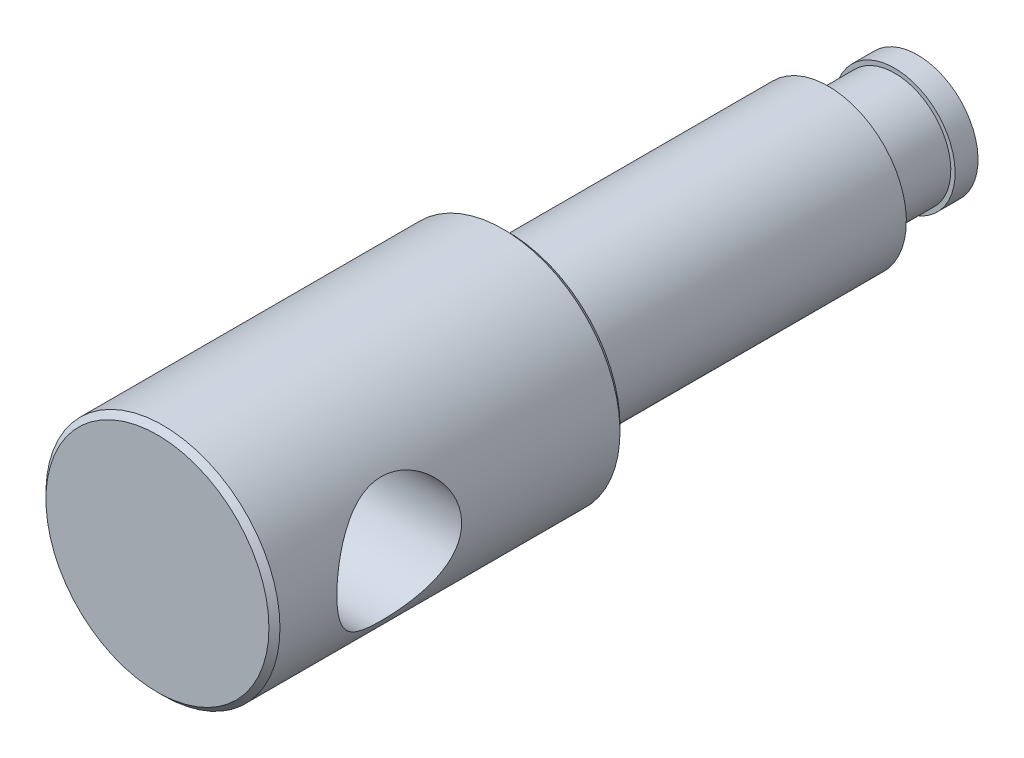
ISO-10303-21;
HEADER;
FILE_DESCRIPTION(('STEP AP214'),'2;1');
FILE_NAME('part.step','',(''),(''),'','','');
FILE_SCHEMA(('AUTOMOTIVE_DESIGN { 1 0 10303 214 1 1 1 1 }'));
ENDSEC;
DATA;
#1=APPLICATION_CONTEXT('core data for automotive mechanical design processes');
#2=APPLICATION_PROTOCOL_DEFINITION('international standard','automotive_design',2000,#1);
#3=PRODUCT_CONTEXT('',#1,'mechanical');
#4=PRODUCT('Part','Part','',(#3));
#5=PRODUCT_RELATED_PRODUCT_CATEGORY('part','',(#4));
#6=PRODUCT_DEFINITION_FORMATION('','',#4);
#7=PRODUCT_DEFINITION_CONTEXT('part definition',#1,'design');
#8=PRODUCT_DEFINITION('design','',#6,#7);
#9=PRODUCT_DEFINITION_SHAPE('','',#8);
#10=(LENGTH_UNIT() NAMED_UNIT(*) SI_UNIT(.MILLI.,.METRE.));
#11=(NAMED_UNIT(*) PLANE_ANGLE_UNIT() SI_UNIT($,.RADIAN.));
#12=(NAMED_UNIT(*) SI_UNIT($,.STERADIAN.) SOLID_ANGLE_UNIT());
#13=UNCERTAINTY_MEASURE_WITH_UNIT(LENGTH_MEASURE(1.E-05),#10,'distance_accuracy_value','');
#14=(GEOMETRIC_REPRESENTATION_CONTEXT(3) GLOBAL_UNCERTAINTY_ASSIGNED_CONTEXT((#13)) GLOBAL_UNIT_ASSIGNED_CONTEXT((#10,
#11,#12)) REPRESENTATION_CONTEXT('',''));
#15=CARTESIAN_POINT('',(0.,0.,0.));
#16=DIRECTION('',(0.,0.,1.));
#17=DIRECTION('',(1.,0.,0.));
#18=AXIS2_PLACEMENT_3D('',#15,#16,#17);
#19=CARTESIAN_POINT('',(0.,0.,13.));
#20=DIRECTION('',(-1.,0.,0.));
#21=DIRECTION('',(0.,1.,0.));
#22=AXIS2_PLACEMENT_3D('',#19,#20,#21);
#23=SPHERICAL_SURFACE('',#22,13.);
#24=CARTESIAN_POINT('',(0.,0.,2.56268712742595));
#25=DIRECTION('',(0.,0.,1.));
#26=DIRECTION('',(0.,-1.,0.));
#27=AXIS2_PLACEMENT_3D('',#24,#25,#26);
#28=CIRCLE('',#27,7.75);
#29=CARTESIAN_POINT('',(0.,-7.75,2.56268712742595));
#30=VERTEX_POINT('',#29);
#31=EDGE_CURVE('E112',#30,#30,#28,.T.);
#32=ORIENTED_EDGE('',*,*,#31,.F.);
#33=EDGE_LOOP('',(#32));
#34=FACE_BOUND('',#33,.T.);
#35=ADVANCED_FACE('F12',(#34),#23,.T.);
#36=CARTESIAN_POINT('',(0.,0.,0.));
#37=DIRECTION('',(0.,0.,1.));
#38=DIRECTION('',(0.,-1.,0.));
#39=AXIS2_PLACEMENT_3D('',#36,#37,#38);
#40=CYLINDRICAL_SURFACE('',#39,7.75);
#41=CARTESIAN_POINT('',(0.,0.,5.5));
#42=DIRECTION('',(0.,0.,1.));
#43=DIRECTION('',(0.,-1.,0.));
#44=AXIS2_PLACEMENT_3D('',#41,#42,#43);
#45=CIRCLE('',#44,7.75);
#46=CARTESIAN_POINT('',(0.,-7.75,5.5));
#47=VERTEX_POINT('',#46);
#48=EDGE_CURVE('E113',#47,#47,#45,.F.);
#49=ORIENTED_EDGE('',*,*,#48,.T.);
#50=EDGE_LOOP('',(#49));
#51=FACE_BOUND('',#50,.T.);
#52=ORIENTED_EDGE('',*,*,#31,.T.);
#53=EDGE_LOOP('',(#52));
#54=FACE_BOUND('',#53,.T.);
#55=ADVANCED_FACE('F75',(#51,#54),#40,.T.);
#56=CARTESIAN_POINT('',(7.2,0.,5.5));
#57=DIRECTION('',(0.,0.,-1.));
#58=DIRECTION('',(0.,1.,0.));
#59=AXIS2_PLACEMENT_3D('',#56,#57,#58);
#60=PLANE('',#59);
#61=CARTESIAN_POINT('',(0.,0.,5.5));
#62=DIRECTION('',(0.,0.,1.));
#63=DIRECTION('',(0.,-1.,0.));
#64=AXIS2_PLACEMENT_3D('',#61,#62,#63);
#65=CIRCLE('',#64,7.2);
#66=CARTESIAN_POINT('',(0.,-7.2,5.5));
#67=VERTEX_POINT('',#66);
#68=EDGE_CURVE('E94',#67,#67,#65,.T.);
#69=ORIENTED_EDGE('',*,*,#68,.F.);
#70=EDGE_LOOP('',(#69));
#71=FACE_BOUND('',#70,.T.);
#72=ORIENTED_EDGE('',*,*,#48,.F.);
#73=EDGE_LOOP('',(#72));
#74=FACE_BOUND('',#73,.T.);
#75=ADVANCED_FACE('F71',(#71,#74),#60,.F.);
#76=CARTESIAN_POINT('',(0.,0.,0.));
#77=DIRECTION('',(0.,0.,1.));
#78=DIRECTION('',(0.,-1.,0.));
#79=AXIS2_PLACEMENT_3D('',#76,#77,#78);
#80=CYLINDRICAL_SURFACE('',#79,7.2);
#81=CARTESIAN_POINT('',(0.,0.,12.383419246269));
#82=DIRECTION('',(0.,0.,1.));
#83=DIRECTION('',(0.,-1.,0.));
#84=AXIS2_PLACEMENT_3D('',#81,#82,#83);
#85=CIRCLE('',#84,7.2);
#86=CARTESIAN_POINT('',(0.,-7.2,12.383419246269));
#87=VERTEX_POINT('',#86);
#88=EDGE_CURVE('E90',#87,#87,#85,.T.);
#89=ORIENTED_EDGE('',*,*,#88,.F.);
#90=EDGE_LOOP('',(#89));
#91=FACE_BOUND('',#90,.T.);
#92=ORIENTED_EDGE('',*,*,#68,.T.);
#93=EDGE_LOOP('',(#92));
#94=FACE_BOUND('',#93,.T.);
#95=ADVANCED_FACE('F67',(#91,#94),#80,.T.);
#96=CARTESIAN_POINT('',(0.,0.,14.));
#97=DIRECTION('',(0.,0.,1.));
#98=DIRECTION('',(-1.,0.,0.));
#99=AXIS2_PLACEMENT_3D('',#96,#97,#98);
#100=CONICAL_SURFACE('',#99,10.,1.0471975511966);
#101=CARTESIAN_POINT('',(0.,0.,14.));
#102=DIRECTION('',(0.,0.,1.));
#103=DIRECTION('',(0.,-1.,0.));
#104=AXIS2_PLACEMENT_3D('',#101,#102,#103);
#105=CIRCLE('',#104,10.);
#106=CARTESIAN_POINT('',(0.,-10.,14.));
#107=VERTEX_POINT('',#106);
#108=EDGE_CURVE('E97',#107,#107,#105,.T.);
#109=ORIENTED_EDGE('',*,*,#108,.F.);
#110=EDGE_LOOP('',(#109));
#111=FACE_BOUND('',#110,.T.);
#112=ORIENTED_EDGE('',*,*,#88,.T.);
#113=EDGE_LOOP('',(#112));
#114=FACE_BOUND('',#113,.T.);
#115=ADVANCED_FACE('F63',(#111,#114),#100,.T.);
#116=CARTESIAN_POINT('',(0.,0.,0.));
#117=DIRECTION('',(0.,0.,1.));
#118=DIRECTION('',(0.,-1.,0.));
#119=AXIS2_PLACEMENT_3D('',#116,#117,#118);
#120=CYLINDRICAL_SURFACE('',#119,10.);
#121=CARTESIAN_POINT('',(0.,0.,55.));
#122=DIRECTION('',(0.,0.,1.));
#123=DIRECTION('',(0.,-1.,0.));
#124=AXIS2_PLACEMENT_3D('',#121,#122,#123);
#125=CIRCLE('',#124,10.);
#126=CARTESIAN_POINT('',(0.,-10.,55.));
#127=VERTEX_POINT('',#126);
#128=EDGE_CURVE('E93',#127,#127,#125,.F.);
#129=ORIENTED_EDGE('',*,*,#128,.T.);
#130=EDGE_LOOP('',(#129));
#131=FACE_BOUND('',#130,.T.);
#132=ORIENTED_EDGE('',*,*,#108,.T.);
#133=EDGE_LOOP('',(#132));
#134=FACE_BOUND('',#133,.T.);
#135=ADVANCED_FACE('F59',(#131,#134),#120,.T.);
#136=CARTESIAN_POINT('',(14.2928932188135,0.,55.));
#137=DIRECTION('',(0.,0.,1.));
#138=DIRECTION('',(0.,-1.,0.));
#139=AXIS2_PLACEMENT_3D('',#136,#137,#138);
#140=PLANE('',#139);
#141=CARTESIAN_POINT('',(0.,0.,55.));
#142=DIRECTION('',(0.,0.,1.));
#143=DIRECTION('',(0.,-1.,0.));
#144=AXIS2_PLACEMENT_3D('',#141,#142,#143);
#145=CIRCLE('',#144,14.2928932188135);
#146=CARTESIAN_POINT('',(0.,-14.2928932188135,55.));
#147=VERTEX_POINT('',#146);
#148=EDGE_CURVE('E100',#147,#147,#145,.T.);
#149=ORIENTED_EDGE('',*,*,#148,.F.);
#150=EDGE_LOOP('',(#149));
#151=FACE_BOUND('',#150,.T.);
#152=ORIENTED_EDGE('',*,*,#128,.F.);
#153=EDGE_LOOP('',(#152));
#154=FACE_BOUND('',#153,.T.);
#155=ADVANCED_FACE('F55',(#151,#154),#140,.F.);
#156=CARTESIAN_POINT('',(0.,0.,100.));
#157=DIRECTION('',(0.,0.,-1.));
#158=DIRECTION('',(0.,1.,0.));
#159=AXIS2_PLACEMENT_3D('',#156,#157,#158);
#160=PLANE('',#159);
#161=CARTESIAN_POINT('',(0.,0.,100.));
#162=DIRECTION('',(0.,0.,-1.));
#163=DIRECTION('',(1.,0.,0.));
#164=AXIS2_PLACEMENT_3D('',#161,#162,#163);
#165=CIRCLE('',#164,14.2928932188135);
#166=CARTESIAN_POINT('',(14.2928932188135,0.,100.));
#167=VERTEX_POINT('',#166);
#168=EDGE_CURVE('E86',#167,#167,#165,.T.);
#169=ORIENTED_EDGE('',*,*,#168,.F.);
#170=EDGE_LOOP('',(#169));
#171=FACE_BOUND('',#170,.T.);
#172=ADVANCED_FACE('F51',(#171),#160,.F.);
#173=CARTESIAN_POINT('',(0.,0.,55.7071067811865));
#174=DIRECTION('',(0.,0.,1.));
#175=DIRECTION('',(0.,-1.,0.));
#176=AXIS2_PLACEMENT_3D('',#173,#174,#175);
#177=CONICAL_SURFACE('',#176,15.,0.78539816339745);
#178=CARTESIAN_POINT('',(0.,0.,55.7071067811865));
#179=DIRECTION('',(0.,0.,1.));
#180=DIRECTION('',(0.,-1.,0.));
#181=AXIS2_PLACEMENT_3D('',#178,#179,#180);
#182=CIRCLE('',#181,15.);
#183=CARTESIAN_POINT('',(0.,-15.,55.7071067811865));
#184=VERTEX_POINT('',#183);
#185=EDGE_CURVE('E27',#184,#184,#182,.T.);
#186=ORIENTED_EDGE('',*,*,#185,.F.);
#187=EDGE_LOOP('',(#186));
#188=FACE_BOUND('',#187,.T.);
#189=ORIENTED_EDGE('',*,*,#148,.T.);
#190=EDGE_LOOP('',(#189));
#191=FACE_BOUND('',#190,.T.);
#192=ADVANCED_FACE('F47',(#188,#191),#177,.T.);
#193=CARTESIAN_POINT('',(0.,0.,99.2928932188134));
#194=DIRECTION('',(0.,0.,-1.));
#195=DIRECTION('',(1.,0.,0.));
#196=AXIS2_PLACEMENT_3D('',#193,#194,#195);
#197=CONICAL_SURFACE('',#196,15.,0.785398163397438);
#198=ORIENTED_EDGE('',*,*,#168,.T.);
#199=EDGE_LOOP('',(#198));
#200=FACE_BOUND('',#199,.T.);
#201=CARTESIAN_POINT('',(0.,0.,99.2928932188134));
#202=DIRECTION('',(0.,0.,1.));
#203=DIRECTION('',(0.,-1.,0.));
#204=AXIS2_PLACEMENT_3D('',#201,#202,#203);
#205=CIRCLE('',#204,15.);
#206=CARTESIAN_POINT('',(0.,-15.,99.2928932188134));
#207=VERTEX_POINT('',#206);
#208=EDGE_CURVE('E31',#207,#207,#205,.F.);
#209=ORIENTED_EDGE('',*,*,#208,.F.);
#210=EDGE_LOOP('',(#209));
#211=FACE_BOUND('',#210,.T.);
#212=ADVANCED_FACE('F42',(#200,#211),#197,.T.);
#213=CARTESIAN_POINT('',(0.,0.,0.));
#214=DIRECTION('',(0.,0.,1.));
#215=DIRECTION('',(0.,-1.,0.));
#216=AXIS2_PLACEMENT_3D('',#213,#214,#215);
#217=CYLINDRICAL_SURFACE('',#216,15.);
#218=CARTESIAN_POINT('',(-12.6885775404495,8.,84.));
#219=CARTESIAN_POINT('',(-12.6885765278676,8.00000082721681,83.7937192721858));
#220=CARTESIAN_POINT('',(-12.6936244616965,7.99201174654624,83.5874478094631));
#221=CARTESIAN_POINT('',(-12.7136132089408,7.96017537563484,83.1765400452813));
#222=CARTESIAN_POINT('',(-12.728557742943,7.93632212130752,82.9719043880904));
#223=CARTESIAN_POINT('',(-12.7677833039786,7.87306095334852,82.5656970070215));
#224=CARTESIAN_POINT('',(-12.7920765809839,7.83363262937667,82.3641296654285));
#225=CARTESIAN_POINT('',(-12.8491080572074,7.73973085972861,81.9656728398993));
#226=CARTESIAN_POINT('',(-12.8818499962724,7.68525075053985,81.7687854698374));
#227=CARTESIAN_POINT('',(-12.9544169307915,7.56228385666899,81.3822259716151));
#228=CARTESIAN_POINT('',(-12.9941952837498,7.49388888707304,81.1925157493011));
#229=CARTESIAN_POINT('',(-13.0797616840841,7.34352220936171,80.8198944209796));
#230=CARTESIAN_POINT('',(-13.125551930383,7.26154553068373,80.6369858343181));
#231=CARTESIAN_POINT('',(-13.2218490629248,7.08468954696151,80.2788389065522));
#232=CARTESIAN_POINT('',(-13.2723552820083,6.98981206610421,80.1035994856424));
#233=CARTESIAN_POINT('',(-13.3767912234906,6.78781438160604,79.7614752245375));
#234=CARTESIAN_POINT('',(-13.4307210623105,6.68069376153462,79.5945906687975));
#235=CARTESIAN_POINT('',(-13.6062056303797,6.32032913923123,79.0765057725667));
#236=CARTESIAN_POINT('',(-13.7320055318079,6.04463813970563,78.7417984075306));
#237=CARTESIAN_POINT('',(-13.9190407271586,5.59347847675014,78.2763747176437));
#238=CARTESIAN_POINT('',(-13.98114670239,5.43671146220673,78.1272578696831));
#239=CARTESIAN_POINT('',(-14.1034342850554,5.11109924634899,77.8417949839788));
#240=CARTESIAN_POINT('',(-14.1636155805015,4.94225210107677,77.7054510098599));
#241=CARTESIAN_POINT('',(-14.2852717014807,4.57935642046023,77.4361169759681));
#242=CARTESIAN_POINT('',(-14.3464672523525,4.38437188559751,77.3042605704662));
#243=CARTESIAN_POINT('',(-14.463211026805,3.98237404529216,77.0576470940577));
#244=CARTESIAN_POINT('',(-14.5187616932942,3.77536600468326,76.9428826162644));
#245=CARTESIAN_POINT('',(-14.6226346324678,3.35057394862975,76.7315814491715));
#246=CARTESIAN_POINT('',(-14.6709590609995,3.13279317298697,76.635039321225));
#247=CARTESIAN_POINT('',(-14.7589385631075,2.68795642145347,76.4613076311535));
#248=CARTESIAN_POINT('',(-14.7985947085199,2.4609015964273,76.3841156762));
#249=CARTESIAN_POINT('',(-14.8652391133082,2.01763632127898,76.2554462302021));
#250=CARTESIAN_POINT('',(-14.8929813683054,1.80198906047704,76.2024175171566));
#251=CARTESIAN_POINT('',(-14.9392726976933,1.36607301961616,76.1143627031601));
#252=CARTESIAN_POINT('',(-14.9578222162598,1.14580446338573,76.0793357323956));
#253=CARTESIAN_POINT('',(-14.9851777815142,0.70264115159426,76.0277964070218));
#254=CARTESIAN_POINT('',(-14.9939895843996,0.479748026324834,76.0112731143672));
#255=CARTESIAN_POINT('',(-15.0016248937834,0.0331964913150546,75.9969512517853));
#256=CARTESIAN_POINT('',(-15.0004491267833,-0.190461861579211,75.9991513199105));
#257=CARTESIAN_POINT('',(-14.9887583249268,-0.614471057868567,76.0210937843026));
#258=CARTESIAN_POINT('',(-14.9791774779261,-0.814941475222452,76.0390815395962));
#259=CARTESIAN_POINT('',(-14.9521717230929,-1.2134408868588,76.0900122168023));
#260=CARTESIAN_POINT('',(-14.9347467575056,-1.41146986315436,76.1229552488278));
#261=CARTESIAN_POINT('',(-14.8924644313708,-1.80372417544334,76.2034195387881));
#262=CARTESIAN_POINT('',(-14.8676071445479,-1.99794954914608,76.2509406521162));
#263=CARTESIAN_POINT('',(-14.811029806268,-2.3813778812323,76.3600538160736));
#264=CARTESIAN_POINT('',(-14.7793094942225,-2.57058064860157,76.4216464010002));
#265=CARTESIAN_POINT('',(-14.7092919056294,-2.94506910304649,76.559112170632));
#266=CARTESIAN_POINT('',(-14.6709217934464,-3.13028273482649,76.6351445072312));
#267=CARTESIAN_POINT('',(-14.5886953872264,-3.49352300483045,76.8003370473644));
#268=CARTESIAN_POINT('',(-14.5448372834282,-3.67154724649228,76.8895015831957));
#269=CARTESIAN_POINT('',(-14.4063856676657,-4.19348838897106,77.1756349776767));
#270=CARTESIAN_POINT('',(-14.3048709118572,-4.52549971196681,77.3913274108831));
#271=CARTESIAN_POINT('',(-14.0802637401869,-5.1845632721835,77.8918980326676));
#272=CARTESIAN_POINT('',(-13.9560254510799,-5.50754077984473,78.1816280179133));
#273=CARTESIAN_POINT('',(-13.7688338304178,-5.95360340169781,78.6519684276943));
#274=CARTESIAN_POINT('',(-13.7062463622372,-6.0959904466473,78.8148531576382));
#275=CARTESIAN_POINT('',(-13.5822961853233,-6.36737369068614,79.1519741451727));
#276=CARTESIAN_POINT('',(-13.5209336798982,-6.49636768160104,79.3262122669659));
#277=CARTESIAN_POINT('',(-13.3962802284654,-6.74990405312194,79.6995699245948));
#278=CARTESIAN_POINT('',(-13.3332248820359,-6.8732738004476,79.8995659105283));
#279=CARTESIAN_POINT('',(-13.2125488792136,-7.10248719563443,80.3108189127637));
#280=CARTESIAN_POINT('',(-13.154925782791,-7.20833872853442,80.5220708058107));
#281=CARTESIAN_POINT('',(-13.0472441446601,-7.40146247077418,80.9546088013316));
#282=CARTESIAN_POINT('',(-12.9971807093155,-7.48874671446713,81.1758882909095));
#283=CARTESIAN_POINT('',(-12.9066564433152,-7.64370915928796,81.6271145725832));
#284=CARTESIAN_POINT('',(-12.8661941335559,-7.71139038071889,81.8570600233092));
#285=CARTESIAN_POINT('',(-12.7995566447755,-7.82145437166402,82.304826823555));
#286=CARTESIAN_POINT('',(-12.7724893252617,-7.86544291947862,82.5221203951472));
#287=CARTESIAN_POINT('',(-12.7292029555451,-7.93530677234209,82.9606769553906));
#288=CARTESIAN_POINT('',(-12.7129832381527,-7.96118319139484,83.1819396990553));
#289=CARTESIAN_POINT('',(-12.6921440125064,-7.99436472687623,83.6262169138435));
#290=CARTESIAN_POINT('',(-12.6875148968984,-8.00168522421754,83.8492297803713));
#291=CARTESIAN_POINT('',(-12.6900500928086,-7.99766461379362,84.2950087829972));
#292=CARTESIAN_POINT('',(-12.6972133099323,-7.9863252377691,84.5177749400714));
#293=CARTESIAN_POINT('',(-12.7212695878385,-7.94793800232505,84.9314055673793));
#294=CARTESIAN_POINT('',(-12.7367415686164,-7.92318043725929,85.122571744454));
#295=CARTESIAN_POINT('',(-12.7757602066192,-7.86010987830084,85.501879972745));
#296=CARTESIAN_POINT('',(-12.7993094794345,-7.82179249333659,85.6900210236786));
#297=CARTESIAN_POINT('',(-12.8537208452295,-7.73205060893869,86.0620403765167));
#298=CARTESIAN_POINT('',(-12.8845823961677,-7.68062708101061,86.2459189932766));
#299=CARTESIAN_POINT('',(-12.9527088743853,-7.56517167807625,86.6085243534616));
#300=CARTESIAN_POINT('',(-12.9899763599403,-7.50113476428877,86.7872490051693));
#301=CARTESIAN_POINT('',(-13.0716388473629,-7.35794410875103,87.1463708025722));
#302=CARTESIAN_POINT('',(-13.1162747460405,-7.27825059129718,87.3264975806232));
#303=CARTESIAN_POINT('',(-13.2102058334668,-7.10633908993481,87.6794698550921));
#304=CARTESIAN_POINT('',(-13.2595025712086,-7.01411693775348,87.8523129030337));
#305=CARTESIAN_POINT('',(-13.3615387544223,-6.81773611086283,88.19006493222));
#306=CARTESIAN_POINT('',(-13.4142789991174,-6.71357466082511,88.3549720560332));
#307=CARTESIAN_POINT('',(-13.5220005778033,-6.49387939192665,88.6762602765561));
#308=CARTESIAN_POINT('',(-13.5769820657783,-6.37834479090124,88.8326407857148));
#309=CARTESIAN_POINT('',(-13.6962134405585,-6.11858240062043,89.1587368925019));
#310=CARTESIAN_POINT('',(-13.7606355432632,-5.97263494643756,89.3270233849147));
#311=CARTESIAN_POINT('',(-13.8892269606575,-5.66717190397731,89.650904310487));
#312=CARTESIAN_POINT('',(-13.9533962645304,-5.50765574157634,89.8064982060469));
#313=CARTESIAN_POINT('',(-14.0799012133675,-5.17570667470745,90.104243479));
#314=CARTESIAN_POINT('',(-14.1422360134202,-5.00326794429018,90.2463887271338));
#315=CARTESIAN_POINT('',(-14.2634999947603,-4.64630001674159,90.5162849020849));
#316=CARTESIAN_POINT('',(-14.3224287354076,-4.46176926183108,90.6440339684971));
#317=CARTESIAN_POINT('',(-14.4377604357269,-4.0735448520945,90.8892029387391));
#318=CARTESIAN_POINT('',(-14.4939538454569,-3.86937210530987,91.0059650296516));
#319=CARTESIAN_POINT('',(-14.5994119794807,-3.45019516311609,91.2216115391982));
#320=CARTESIAN_POINT('',(-14.6486799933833,-3.23519617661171,91.3205044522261));
#321=CARTESIAN_POINT('',(-14.7388392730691,-2.7958660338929,91.4992893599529));
#322=CARTESIAN_POINT('',(-14.7797350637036,-2.57153999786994,91.5791916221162));
#323=CARTESIAN_POINT('',(-14.8519055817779,-2.11523636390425,91.7189823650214));
#324=CARTESIAN_POINT('',(-14.8831816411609,-1.88325983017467,91.7788736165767));
#325=CARTESIAN_POINT('',(-14.9325301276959,-1.43696201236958,91.872857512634));
#326=CARTESIAN_POINT('',(-14.9516024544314,-1.22316354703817,91.9089157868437));
#327=CARTESIAN_POINT('',(-14.980590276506,-0.792732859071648,91.9635812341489));
#328=CARTESIAN_POINT('',(-14.9905063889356,-0.57610082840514,91.9821895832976));
#329=CARTESIAN_POINT('',(-15.0009003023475,-0.141899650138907,92.0016921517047));
#330=CARTESIAN_POINT('',(-15.0013817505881,0.0756691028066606,92.0025932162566));
#331=CARTESIAN_POINT('',(-14.9929015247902,0.509967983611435,91.9866853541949));
#332=CARTESIAN_POINT('',(-14.9839402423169,0.72669814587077,91.9698771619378));
#333=CARTESIAN_POINT('',(-14.9579364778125,1.13993624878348,91.9208744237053));
#334=CARTESIAN_POINT('',(-14.9416116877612,1.33665343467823,91.8900446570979));
#335=CARTESIAN_POINT('',(-14.9015877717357,1.72658766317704,91.8139852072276));
#336=CARTESIAN_POINT('',(-14.8778861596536,1.91980350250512,91.7687506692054));
#337=CARTESIAN_POINT('',(-14.8236550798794,2.30138685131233,91.6643809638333));
#338=CARTESIAN_POINT('',(-14.7931277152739,2.48975583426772,91.6052500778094));
#339=CARTESIAN_POINT('',(-14.7258931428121,2.86070279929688,91.4736289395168));
#340=CARTESIAN_POINT('',(-14.6891835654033,3.04327852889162,91.4011335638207));
#341=CARTESIAN_POINT('',(-14.6088870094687,3.40831874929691,91.2404833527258));
#342=CARTESIAN_POINT('',(-14.5650946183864,3.59052521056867,91.1518453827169));
#343=CARTESIAN_POINT('',(-14.4726171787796,3.94680147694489,90.9615775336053));
#344=CARTESIAN_POINT('',(-14.4239303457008,4.1208682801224,90.8599429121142));
#345=CARTESIAN_POINT('',(-14.3226773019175,4.46007274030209,90.6444064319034));
#346=CARTESIAN_POINT('',(-14.27011056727,4.62520918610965,90.5305029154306));
#347=CARTESIAN_POINT('',(-14.1621589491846,4.94589577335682,90.2911174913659));
#348=CARTESIAN_POINT('',(-14.1067738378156,5.10144513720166,90.1656346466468));
#349=CARTESIAN_POINT('',(-13.9880757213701,5.41899884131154,89.8892706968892));
#350=CARTESIAN_POINT('',(-13.9245623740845,5.57982089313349,89.7371149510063));
#351=CARTESIAN_POINT('',(-13.7969814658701,5.88822197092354,89.4201245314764));
#352=CARTESIAN_POINT('',(-13.7329138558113,6.03579980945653,89.2552887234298));
#353=CARTESIAN_POINT('',(-13.6057891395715,6.31714795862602,88.9135205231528));
#354=CARTESIAN_POINT('',(-13.5427332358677,6.45090273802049,88.7365748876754));
#355=CARTESIAN_POINT('',(-13.4194175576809,6.70365634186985,88.3715300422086));
#356=CARTESIAN_POINT('',(-13.3591576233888,6.82265601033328,88.18343147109));
#357=CARTESIAN_POINT('',(-13.2400605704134,7.05111918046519,87.7864183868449));
#358=CARTESIAN_POINT('',(-13.1814769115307,7.15971815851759,87.5769282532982));
#359=CARTESIAN_POINT('',(-13.0714949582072,7.35859675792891,87.1475443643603));
#360=CARTESIAN_POINT('',(-13.0200978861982,7.44887326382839,86.9276488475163));
#361=CARTESIAN_POINT('',(-12.926727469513,7.60975396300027,86.4795451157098));
#362=CARTESIAN_POINT('',(-12.8847276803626,7.68041349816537,86.2513623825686));
#363=CARTESIAN_POINT('',(-12.8119002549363,7.80129547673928,85.7880295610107));
#364=CARTESIAN_POINT('',(-12.7810652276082,7.85153144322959,85.5528841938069));
#365=CARTESIAN_POINT('',(-12.7342469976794,7.92721566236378,85.0988312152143));
#366=CARTESIAN_POINT('',(-12.7171886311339,7.95446803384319,84.8803344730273));
#367=CARTESIAN_POINT('',(-12.6943542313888,7.99086010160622,84.4412216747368));
#368=CARTESIAN_POINT('',(-12.6885786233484,7.99999911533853,84.2206055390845));
#369=CARTESIAN_POINT('',(-12.6885775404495,8.,84.));
#370=B_SPLINE_CURVE_WITH_KNOTS('',3,(#218,#219,#220,#221,#222,#223,#224,#225,#226,#227,#228,
#229,#230,#231,#232,#233,#234,#235,#236,#237,#238,#239,#240,#241,#242,#243,#244,#245,#246,#247,
#248,#249,#250,#251,#252,#253,#254,#255,#256,#257,#258,#259,#260,#261,#262,#263,#264,#265,#266,
#267,#268,#269,#270,#271,#272,#273,#274,#275,#276,#277,#278,#279,#280,#281,#282,#283,#284,#285,
#286,#287,#288,#289,#290,#291,#292,#293,#294,#295,#296,#297,#298,#299,#300,#301,#302,#303,#304,
#305,#306,#307,#308,#309,#310,#311,#312,#313,#314,#315,#316,#317,#318,#319,#320,#321,#322,#323,
#324,#325,#326,#327,#328,#329,#330,#331,#332,#333,#334,#335,#336,#337,#338,#339,#340,#341,#342,
#343,#344,#345,#346,#347,#348,#349,#350,#351,#352,#353,#354,#355,#356,#357,#358,#359,#360,#361,
#362,#363,#364,#365,#366,#367,#368,#369),.UNSPECIFIED.,.T.,.F.,(4,2,2,2,2,2,2,2,2,2,2,2,2,2,2,2,
2,2,2,2,2,2,2,2,2,2,2,2,2,2,2,2,2,2,2,2,2,2,2,2,2,2,2,2,2,2,2,2,2,2,2,2,2,2,2,2,2,2,2,2,2,2,2,2,
2,2,2,2,2,2,2,2,2,2,2,4),(0.,0.618612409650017,1.23745751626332,1.85711629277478,
2.47704983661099,3.0930182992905,3.7092126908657,4.3253200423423,4.94144835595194,
6.28932977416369,6.96411577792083,7.63901061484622,8.36770205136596,9.09607678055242,
9.82423377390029,10.5523006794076,11.2227676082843,11.893202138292,12.5632401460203,
13.2332294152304,13.8370243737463,14.4408237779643,15.0446171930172,15.6484335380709,
16.2593380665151,16.8704445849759,18.0919304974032,19.4399210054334,20.1150149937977,
20.7902201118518,21.5191974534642,22.2478457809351,22.9760203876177,23.7040827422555,
24.3731385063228,25.0421531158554,25.7106130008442,26.3790108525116,26.9584945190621,
27.5381660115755,28.1177945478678,28.6976551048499,29.3029446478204,29.9084360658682,
30.5140685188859,31.1197426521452,31.8146386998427,32.5095641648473,33.2048048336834,
33.900135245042,34.6246245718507,35.3487685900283,36.0725201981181,36.796171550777,
37.4482560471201,38.1002965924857,38.7520850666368,39.4038465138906,40.0025200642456,
40.6013955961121,41.2000868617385,41.7990081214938,42.4202632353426,43.041745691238,
43.6633122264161,44.2849291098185,44.9751514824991,45.665435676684,46.3564872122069,
47.0474992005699,47.7759050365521,48.5044346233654,49.2308875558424,49.9568586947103,
50.6184046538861,51.2799755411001),.UNSPECIFIED.);
#371=CARTESIAN_POINT('',(-12.6885775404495,8.,84.));
#372=VERTEX_POINT('',#371);
#373=EDGE_CURVE('E23',#372,#372,#370,.T.);
#374=ORIENTED_EDGE('',*,*,#373,.F.);
#375=EDGE_LOOP('',(#374));
#376=FACE_BOUND('',#375,.T.);
#377=ORIENTED_EDGE('',*,*,#208,.T.);
#378=EDGE_LOOP('',(#377));
#379=FACE_BOUND('',#378,.T.);
#380=CARTESIAN_POINT('',(12.6885775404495,8.,84.));
#381=CARTESIAN_POINT('',(12.6885765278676,8.00000082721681,84.2062807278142));
#382=CARTESIAN_POINT('',(12.6936244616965,7.99201174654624,84.4125521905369));
#383=CARTESIAN_POINT('',(12.7136132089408,7.96017537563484,84.8234599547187));
#384=CARTESIAN_POINT('',(12.728557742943,7.93632212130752,85.0280956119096));
#385=CARTESIAN_POINT('',(12.7677833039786,7.87306095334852,85.4343029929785));
#386=CARTESIAN_POINT('',(12.7920765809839,7.83363262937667,85.6358703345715));
#387=CARTESIAN_POINT('',(12.8491080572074,7.73973085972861,86.0343271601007));
#388=CARTESIAN_POINT('',(12.8818499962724,7.68525075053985,86.2312145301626));
#389=CARTESIAN_POINT('',(12.9544169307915,7.56228385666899,86.617774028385));
#390=CARTESIAN_POINT('',(12.9941952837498,7.49388888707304,86.8074842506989));
#391=CARTESIAN_POINT('',(13.0797616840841,7.3435222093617,87.1801055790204));
#392=CARTESIAN_POINT('',(13.125551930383,7.26154553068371,87.363014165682));
#393=CARTESIAN_POINT('',(13.2218490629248,7.08468954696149,87.7211610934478));
#394=CARTESIAN_POINT('',(13.2723552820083,6.98981206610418,87.8964005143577));
#395=CARTESIAN_POINT('',(13.3767912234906,6.78781438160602,88.2385247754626));
#396=CARTESIAN_POINT('',(13.4307210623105,6.68069376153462,88.4054093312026));
#397=CARTESIAN_POINT('',(13.6062056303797,6.32032913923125,88.9234942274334));
#398=CARTESIAN_POINT('',(13.7320055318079,6.04463813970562,89.2582015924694));
#399=CARTESIAN_POINT('',(13.9190407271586,5.59347847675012,89.7236252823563));
#400=CARTESIAN_POINT('',(13.98114670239,5.43671146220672,89.8727421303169));
#401=CARTESIAN_POINT('',(14.1034342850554,5.11109924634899,90.1582050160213));
#402=CARTESIAN_POINT('',(14.1636155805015,4.94225210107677,90.29454899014));
#403=CARTESIAN_POINT('',(14.2852717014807,4.57935642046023,90.5638830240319));
#404=CARTESIAN_POINT('',(14.3464672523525,4.38437188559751,90.6957394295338));
#405=CARTESIAN_POINT('',(14.463211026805,3.98237404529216,90.9423529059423));
#406=CARTESIAN_POINT('',(14.5187616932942,3.77536600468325,91.0571173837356));
#407=CARTESIAN_POINT('',(14.6226346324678,3.35057394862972,91.2684185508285));
#408=CARTESIAN_POINT('',(14.6709590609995,3.13279317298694,91.364960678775));
#409=CARTESIAN_POINT('',(14.7589385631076,2.68795642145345,91.5386923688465));
#410=CARTESIAN_POINT('',(14.7985947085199,2.4609015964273,91.6158843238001));
#411=CARTESIAN_POINT('',(14.8652391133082,2.01763632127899,91.744553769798));
#412=CARTESIAN_POINT('',(14.8929813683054,1.80198906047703,91.7975824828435));
#413=CARTESIAN_POINT('',(14.9392726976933,1.36607301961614,91.8856372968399));
#414=CARTESIAN_POINT('',(14.9578222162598,1.14580446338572,91.9206642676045));
#415=CARTESIAN_POINT('',(14.9851777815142,0.702641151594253,91.9722035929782));
#416=CARTESIAN_POINT('',(14.9939895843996,0.479748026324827,91.9887268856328));
#417=CARTESIAN_POINT('',(15.0016248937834,0.0331964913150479,92.0030487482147));
#418=CARTESIAN_POINT('',(15.0004491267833,-0.190461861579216,92.0008486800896));
#419=CARTESIAN_POINT('',(14.9887583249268,-0.614471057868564,91.9789062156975));
#420=CARTESIAN_POINT('',(14.9791774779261,-0.814941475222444,91.9609184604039));
#421=CARTESIAN_POINT('',(14.9521717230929,-1.21344088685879,91.9099877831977));
#422=CARTESIAN_POINT('',(14.9347467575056,-1.41146986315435,91.8770447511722));
#423=CARTESIAN_POINT('',(14.8924644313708,-1.80372417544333,91.796580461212));
#424=CARTESIAN_POINT('',(14.8676071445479,-1.99794954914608,91.7490593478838));
#425=CARTESIAN_POINT('',(14.811029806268,-2.3813778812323,91.6399461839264));
#426=CARTESIAN_POINT('',(14.7793094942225,-2.57058064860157,91.5783535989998));
#427=CARTESIAN_POINT('',(14.7092919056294,-2.94506910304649,91.440887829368));
#428=CARTESIAN_POINT('',(14.6709217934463,-3.13028273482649,91.3648554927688));
#429=CARTESIAN_POINT('',(14.5886953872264,-3.49352300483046,91.1996629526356));
#430=CARTESIAN_POINT('',(14.5448372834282,-3.67154724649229,91.1104984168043));
#431=CARTESIAN_POINT('',(14.4063856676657,-4.19348838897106,90.8243650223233));
#432=CARTESIAN_POINT('',(14.3048709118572,-4.52549971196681,90.6086725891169));
#433=CARTESIAN_POINT('',(14.0802637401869,-5.1845632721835,90.1081019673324));
#434=CARTESIAN_POINT('',(13.9560254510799,-5.50754077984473,89.8183719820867));
#435=CARTESIAN_POINT('',(13.7688338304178,-5.95360340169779,89.3480315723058));
#436=CARTESIAN_POINT('',(13.7062463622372,-6.09599044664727,89.1851468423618));
#437=CARTESIAN_POINT('',(13.5822961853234,-6.36737369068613,88.8480258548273));
#438=CARTESIAN_POINT('',(13.5209336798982,-6.49636768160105,88.6737877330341));
#439=CARTESIAN_POINT('',(13.3962802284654,-6.74990405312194,88.3004300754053));
#440=CARTESIAN_POINT('',(13.3332248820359,-6.87327380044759,88.1004340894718));
#441=CARTESIAN_POINT('',(13.2125488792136,-7.1024871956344,87.6891810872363));
#442=CARTESIAN_POINT('',(13.154925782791,-7.2083387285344,87.4779291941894));
#443=CARTESIAN_POINT('',(13.0472441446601,-7.40146247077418,87.0453911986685));
#444=CARTESIAN_POINT('',(12.9971807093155,-7.48874671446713,86.8241117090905));
#445=CARTESIAN_POINT('',(12.9066564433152,-7.64370915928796,86.3728854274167));
#446=CARTESIAN_POINT('',(12.8661941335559,-7.71139038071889,86.1429399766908));
#447=CARTESIAN_POINT('',(12.7995566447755,-7.82145437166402,85.695173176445));
#448=CARTESIAN_POINT('',(12.7724893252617,-7.86544291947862,85.4778796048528));
#449=CARTESIAN_POINT('',(12.7292029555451,-7.93530677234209,85.0393230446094));
#450=CARTESIAN_POINT('',(12.7129832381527,-7.96118319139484,84.8180603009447));
#451=CARTESIAN_POINT('',(12.6921440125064,-7.99436472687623,84.3737830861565));
#452=CARTESIAN_POINT('',(12.6875148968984,-8.00168522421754,84.1507702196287));
#453=CARTESIAN_POINT('',(12.6900500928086,-7.99766461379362,83.7049912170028));
#454=CARTESIAN_POINT('',(12.6972133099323,-7.9863252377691,83.4822250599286));
#455=CARTESIAN_POINT('',(12.7212695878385,-7.94793800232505,83.0685944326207));
#456=CARTESIAN_POINT('',(12.7367415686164,-7.92318043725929,82.877428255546));
#457=CARTESIAN_POINT('',(12.7757602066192,-7.86010987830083,82.498120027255));
#458=CARTESIAN_POINT('',(12.7993094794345,-7.82179249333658,82.3099789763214));
#459=CARTESIAN_POINT('',(12.8537208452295,-7.73205060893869,81.9379596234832));
#460=CARTESIAN_POINT('',(12.8845823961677,-7.68062708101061,81.7540810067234));
#461=CARTESIAN_POINT('',(12.9527088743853,-7.56517167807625,81.3914756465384));
#462=CARTESIAN_POINT('',(12.9899763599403,-7.50113476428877,81.2127509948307));
#463=CARTESIAN_POINT('',(13.0716388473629,-7.35794410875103,80.8536291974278));
#464=CARTESIAN_POINT('',(13.1162747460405,-7.27825059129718,80.6735024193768));
#465=CARTESIAN_POINT('',(13.2102058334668,-7.1063390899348,80.3205301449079));
#466=CARTESIAN_POINT('',(13.2595025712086,-7.01411693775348,80.1476870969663));
#467=CARTESIAN_POINT('',(13.3615387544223,-6.81773611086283,79.80993506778));
#468=CARTESIAN_POINT('',(13.4142789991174,-6.71357466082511,79.6450279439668));
#469=CARTESIAN_POINT('',(13.5220005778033,-6.49387939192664,79.323739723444));
#470=CARTESIAN_POINT('',(13.5769820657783,-6.37834479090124,79.1673592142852));
#471=CARTESIAN_POINT('',(13.6962134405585,-6.11858240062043,78.8412631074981));
#472=CARTESIAN_POINT('',(13.7606355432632,-5.97263494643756,78.6729766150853));
#473=CARTESIAN_POINT('',(13.8892269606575,-5.66717190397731,78.349095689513));
#474=CARTESIAN_POINT('',(13.9533962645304,-5.50765574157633,78.1935017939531));
#475=CARTESIAN_POINT('',(14.0799012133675,-5.17570667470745,77.895756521));
#476=CARTESIAN_POINT('',(14.1422360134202,-5.00326794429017,77.7536112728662));
#477=CARTESIAN_POINT('',(14.2634999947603,-4.64630001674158,77.4837150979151));
#478=CARTESIAN_POINT('',(14.3224287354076,-4.46176926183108,77.3559660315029));
#479=CARTESIAN_POINT('',(14.4377604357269,-4.07354485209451,77.1107970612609));
#480=CARTESIAN_POINT('',(14.4939538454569,-3.86937210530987,76.9940349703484));
#481=CARTESIAN_POINT('',(14.5994119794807,-3.45019516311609,76.7783884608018));
#482=CARTESIAN_POINT('',(14.6486799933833,-3.23519617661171,76.6794955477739));
#483=CARTESIAN_POINT('',(14.7388392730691,-2.7958660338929,76.5007106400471));
#484=CARTESIAN_POINT('',(14.7797350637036,-2.57153999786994,76.4208083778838));
#485=CARTESIAN_POINT('',(14.8519055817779,-2.11523636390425,76.2810176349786));
#486=CARTESIAN_POINT('',(14.8831816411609,-1.88325983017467,76.2211263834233));
#487=CARTESIAN_POINT('',(14.9325301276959,-1.43696201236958,76.127142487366));
#488=CARTESIAN_POINT('',(14.9516024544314,-1.22316354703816,76.0910842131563));
#489=CARTESIAN_POINT('',(14.980590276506,-0.792732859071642,76.0364187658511));
#490=CARTESIAN_POINT('',(14.9905063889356,-0.576100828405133,76.0178104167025));
#491=CARTESIAN_POINT('',(15.0009003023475,-0.141899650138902,75.9983078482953));
#492=CARTESIAN_POINT('',(15.0013817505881,0.0756691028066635,75.9974067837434));
#493=CARTESIAN_POINT('',(14.9929015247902,0.509967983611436,76.0133146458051));
#494=CARTESIAN_POINT('',(14.9839402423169,0.726698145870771,76.0301228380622));
#495=CARTESIAN_POINT('',(14.9579364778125,1.13993624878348,76.0791255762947));
#496=CARTESIAN_POINT('',(14.9416116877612,1.33665343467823,76.1099553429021));
#497=CARTESIAN_POINT('',(14.9015877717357,1.72658766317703,76.1860147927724));
#498=CARTESIAN_POINT('',(14.8778861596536,1.91980350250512,76.2312493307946));
#499=CARTESIAN_POINT('',(14.8236550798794,2.30138685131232,76.3356190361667));
#500=CARTESIAN_POINT('',(14.7931277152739,2.48975583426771,76.3947499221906));
#501=CARTESIAN_POINT('',(14.7258931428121,2.86070279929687,76.5263710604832));
#502=CARTESIAN_POINT('',(14.6891835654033,3.04327852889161,76.5988664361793));
#503=CARTESIAN_POINT('',(14.6088870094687,3.40831874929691,76.7595166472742));
#504=CARTESIAN_POINT('',(14.5650946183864,3.59052521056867,76.8481546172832));
#505=CARTESIAN_POINT('',(14.4726171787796,3.94680147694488,77.0384224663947));
#506=CARTESIAN_POINT('',(14.4239303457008,4.12086828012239,77.1400570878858));
#507=CARTESIAN_POINT('',(14.3226773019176,4.46007274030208,77.3555935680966));
#508=CARTESIAN_POINT('',(14.27011056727,4.62520918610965,77.4694970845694));
#509=CARTESIAN_POINT('',(14.1621589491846,4.94589577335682,77.7088825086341));
#510=CARTESIAN_POINT('',(14.1067738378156,5.10144513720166,77.8343653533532));
#511=CARTESIAN_POINT('',(13.9880757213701,5.41899884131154,78.1107293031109));
#512=CARTESIAN_POINT('',(13.9245623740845,5.57982089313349,78.2628850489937));
#513=CARTESIAN_POINT('',(13.7969814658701,5.88822197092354,78.5798754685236));
#514=CARTESIAN_POINT('',(13.7329138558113,6.03579980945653,78.7447112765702));
#515=CARTESIAN_POINT('',(13.6057891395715,6.31714795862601,79.0864794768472));
#516=CARTESIAN_POINT('',(13.5427332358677,6.45090273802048,79.2634251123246));
#517=CARTESIAN_POINT('',(13.4194175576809,6.70365634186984,79.6284699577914));
#518=CARTESIAN_POINT('',(13.3591576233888,6.82265601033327,79.81656852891));
#519=CARTESIAN_POINT('',(13.2400605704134,7.0511191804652,80.2135816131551));
#520=CARTESIAN_POINT('',(13.1814769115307,7.1597181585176,80.4230717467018));
#521=CARTESIAN_POINT('',(13.0714949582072,7.35859675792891,80.8524556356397));
#522=CARTESIAN_POINT('',(13.0200978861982,7.44887326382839,81.0723511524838));
#523=CARTESIAN_POINT('',(12.926727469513,7.60975396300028,81.5204548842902));
#524=CARTESIAN_POINT('',(12.8847276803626,7.68041349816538,81.7486376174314));
#525=CARTESIAN_POINT('',(12.8119002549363,7.80129547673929,82.2119704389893));
#526=CARTESIAN_POINT('',(12.7810652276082,7.85153144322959,82.4471158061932));
#527=CARTESIAN_POINT('',(12.7342469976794,7.92721566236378,82.9011687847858));
#528=CARTESIAN_POINT('',(12.7171886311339,7.95446803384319,83.1196655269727));
#529=CARTESIAN_POINT('',(12.6943542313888,7.99086010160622,83.5587783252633));
#530=CARTESIAN_POINT('',(12.6885786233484,7.99999911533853,83.7793944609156));
#531=CARTESIAN_POINT('',(12.6885775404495,8.,84.));
#532=B_SPLINE_CURVE_WITH_KNOTS('',3,(#380,#381,#382,#383,#384,#385,#386,#387,#388,#389,#390,
#391,#392,#393,#394,#395,#396,#397,#398,#399,#400,#401,#402,#403,#404,#405,#406,#407,#408,#409,
#410,#411,#412,#413,#414,#415,#416,#417,#418,#419,#420,#421,#422,#423,#424,#425,#426,#427,#428,
#429,#430,#431,#432,#433,#434,#435,#436,#437,#438,#439,#440,#441,#442,#443,#444,#445,#446,#447,
#448,#449,#450,#451,#452,#453,#454,#455,#456,#457,#458,#459,#460,#461,#462,#463,#464,#465,#466,
#467,#468,#469,#470,#471,#472,#473,#474,#475,#476,#477,#478,#479,#480,#481,#482,#483,#484,#485,
#486,#487,#488,#489,#490,#491,#492,#493,#494,#495,#496,#497,#498,#499,#500,#501,#502,#503,#504,
#505,#506,#507,#508,#509,#510,#511,#512,#513,#514,#515,#516,#517,#518,#519,#520,#521,#522,#523,
#524,#525,#526,#527,#528,#529,#530,#531),.UNSPECIFIED.,.T.,.F.,(4,2,2,2,2,2,2,2,2,2,2,2,2,2,2,2,
2,2,2,2,2,2,2,2,2,2,2,2,2,2,2,2,2,2,2,2,2,2,2,2,2,2,2,2,2,2,2,2,2,2,2,2,2,2,2,2,2,2,2,2,2,2,2,2,
2,2,2,2,2,2,2,2,2,2,2,4),(0.,0.618612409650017,1.23745751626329,1.85711629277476,
2.47704983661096,3.09301829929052,3.70921269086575,4.32532004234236,4.94144835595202,
6.28932977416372,6.96411577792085,7.63901061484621,8.36770205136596,9.09607678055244,
9.82423377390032,10.5523006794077,11.2227676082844,11.893202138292,12.5632401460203,
13.2332294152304,13.8370243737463,14.4408237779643,15.0446171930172,15.6484335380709,
16.2593380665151,16.8704445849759,18.0919304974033,19.4399210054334,20.1150149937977,
20.7902201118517,21.5191974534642,22.247845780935,22.9760203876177,23.7040827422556,
24.3731385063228,25.0421531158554,25.7106130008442,26.3790108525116,26.9584945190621,
27.5381660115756,28.1177945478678,28.6976551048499,29.3029446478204,29.9084360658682,
30.5140685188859,31.1197426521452,31.8146386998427,32.5095641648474,33.2048048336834,
33.900135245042,34.6246245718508,35.3487685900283,36.0725201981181,36.796171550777,
37.4482560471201,38.1002965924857,38.7520850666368,39.4038465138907,40.0025200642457,
40.6013955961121,41.2000868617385,41.7990081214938,42.4202632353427,43.041745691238,
43.6633122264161,44.2849291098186,44.9751514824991,45.665435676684,46.3564872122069,
47.0474992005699,47.7759050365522,48.5044346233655,49.2308875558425,49.9568586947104,
50.6184046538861,51.2799755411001),.UNSPECIFIED.);
#533=CARTESIAN_POINT('',(12.6885775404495,8.,84.));
#534=VERTEX_POINT('',#533);
#535=EDGE_CURVE('E8',#534,#534,#532,.T.);
#536=ORIENTED_EDGE('',*,*,#535,.F.);
#537=EDGE_LOOP('',(#536));
#538=FACE_BOUND('',#537,.T.);
#539=ORIENTED_EDGE('',*,*,#185,.T.);
#540=EDGE_LOOP('',(#539));
#541=FACE_BOUND('',#540,.T.);
#542=ADVANCED_FACE('F38',(#376,#379,#538,#541),#217,.T.);
#543=CARTESIAN_POINT('',(-29.0022539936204,0.,84.));
#544=DIRECTION('',(1.,0.,0.));
#545=DIRECTION('',(0.,1.,0.));
#546=AXIS2_PLACEMENT_3D('',#543,#544,#545);
#547=CYLINDRICAL_SURFACE('',#546,8.);
#548=ORIENTED_EDGE('',*,*,#373,.T.);
#549=EDGE_LOOP('',(#548));
#550=FACE_BOUND('',#549,.T.);
#551=ORIENTED_EDGE('',*,*,#535,.T.);
#552=EDGE_LOOP('',(#551));
#553=FACE_BOUND('',#552,.T.);
#554=ADVANCED_FACE('F14',(#550,#553),#547,.F.);
#555=CLOSED_SHELL('',(#35,#55,#75,#95,#115,#135,#155,#172,#192,#212,#542,#554));
#556=MANIFOLD_SOLID_BREP('B1',#555);
#557=ADVANCED_BREP_SHAPE_REPRESENTATION('',(#18,#556),#14);
#558=SHAPE_DEFINITION_REPRESENTATION(#9,#557);
ENDSEC;
END-ISO-10303-21;
